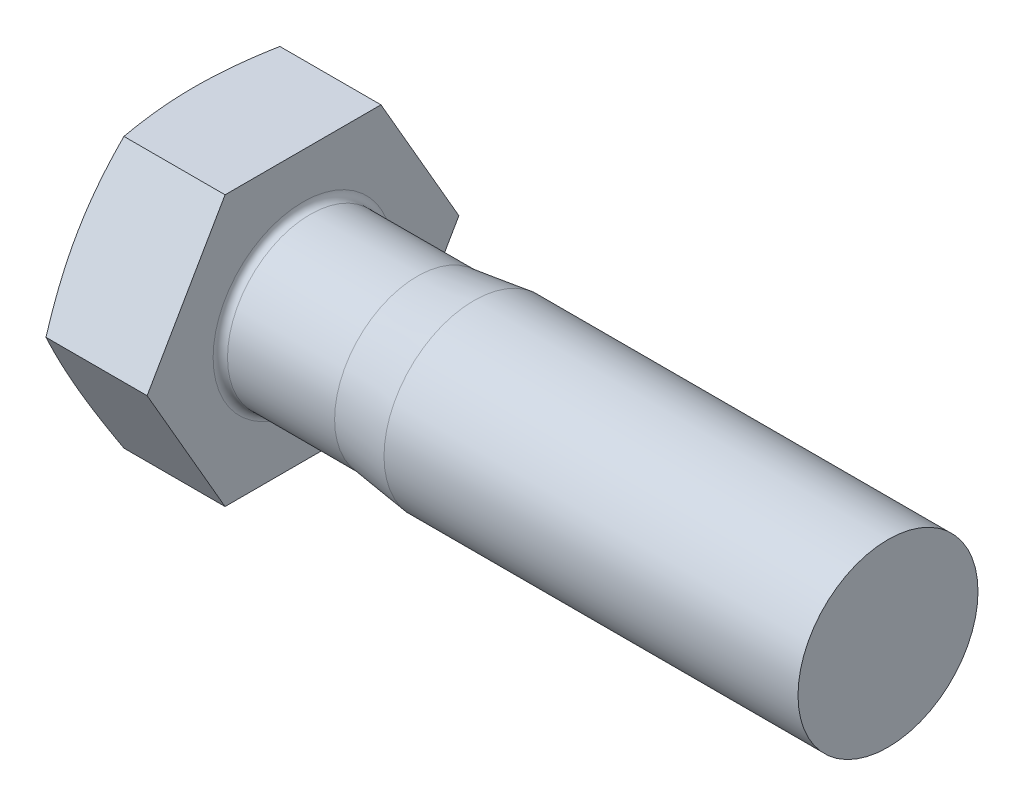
from build123d import *

# Parameters (mm, degrees)
BASEHEAD_DEPTH     = 12.5
SKETCH2_R          = 10
BASEBODY_DEPTH     = 65
SKETCH4_R          = 11.2
CUT_EXTRUDE1_DEPTH = 2.5
HEADFILLET_R       = 0.8


with BuildPart() as part:
    # Sketch1 → BaseHead (new body)
    with BuildSketch(Plane(origin=(0, 0, 0), x_dir=(0, 0, -1), z_dir=(1, 0, 0))):
        Polygon((17.320508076, 0), (8.660254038, 15), (-8.660254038, 15), (-17.320508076, 0), (-8.660254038, -15), (8.660254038, -15), align=None)
    extrude(amount=BASEHEAD_DEPTH)

    # Sketch2 → BaseBody (add)
    with BuildSketch(Plane(origin=(12.5, 0, 0), x_dir=(0, 0, -1), z_dir=(1, 0, 0))):
        Circle(SKETCH2_R)
    extrude(amount=BASEBODY_DEPTH)

    # Sketch3 → HeadChamfer (revolve, cut)
    with BuildSketch(Plane(origin=(3.161211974, 0, 2.612290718), x_dir=(0, 0, -1), z_dir=(0, 1, 0)), mode=Mode.PRIVATE) as headchamfer_sk:
        Polygon((19.932798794, 3.161211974), (19.932798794, 1.898050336), (16.462290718, 3.161211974), align=None)
    revolve(headchamfer_sk.sketch.rotate(Axis((-2.071354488, 0, 0), (1, 0, 0)), 180), axis=Axis((-2.071354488, 0, 0), (1, 0, 0)), mode=Mode.SUBTRACT)

    # Sketch4 → Cut-Extrude1 (cut)
    with BuildSketch(Plane.ZY):
        Circle(SKETCH4_R)
    extrude(amount=-CUT_EXTRUDE1_DEPTH, mode=Mode.SUBTRACT)

    # Sketch5 → Cut-Revolve1 (revolve, cut)
    with BuildSketch(Plane(origin=(-2.67963122, 0, 8.17963122), x_dir=(0, 0, -1), z_dir=(0, 1, 0)), mode=Mode.PRIVATE) as cut_revolve1_sk:
        Polygon((18.17963122, -34.17963122), (17.36763122, -27.87963122), (17.36763122, -15.17963122), (26.55563122, -15.17963122), (26.55563122, -34.17963122), align=None)
    revolve(cut_revolve1_sk.sketch.rotate(Axis((-2.697175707, 0, 0), (1, 0, 0)), 180), axis=Axis((-2.697175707, 0, 0), (1, 0, 0)), mode=Mode.SUBTRACT)

    # HeadFillet
    headfillet_edges = [part.edges().sort_by_distance(p)[0] for p in [
        (12.5, 0, -9.188),
    ]]
    fillet(headfillet_edges, radius=HEADFILLET_R)


solid = part.part
